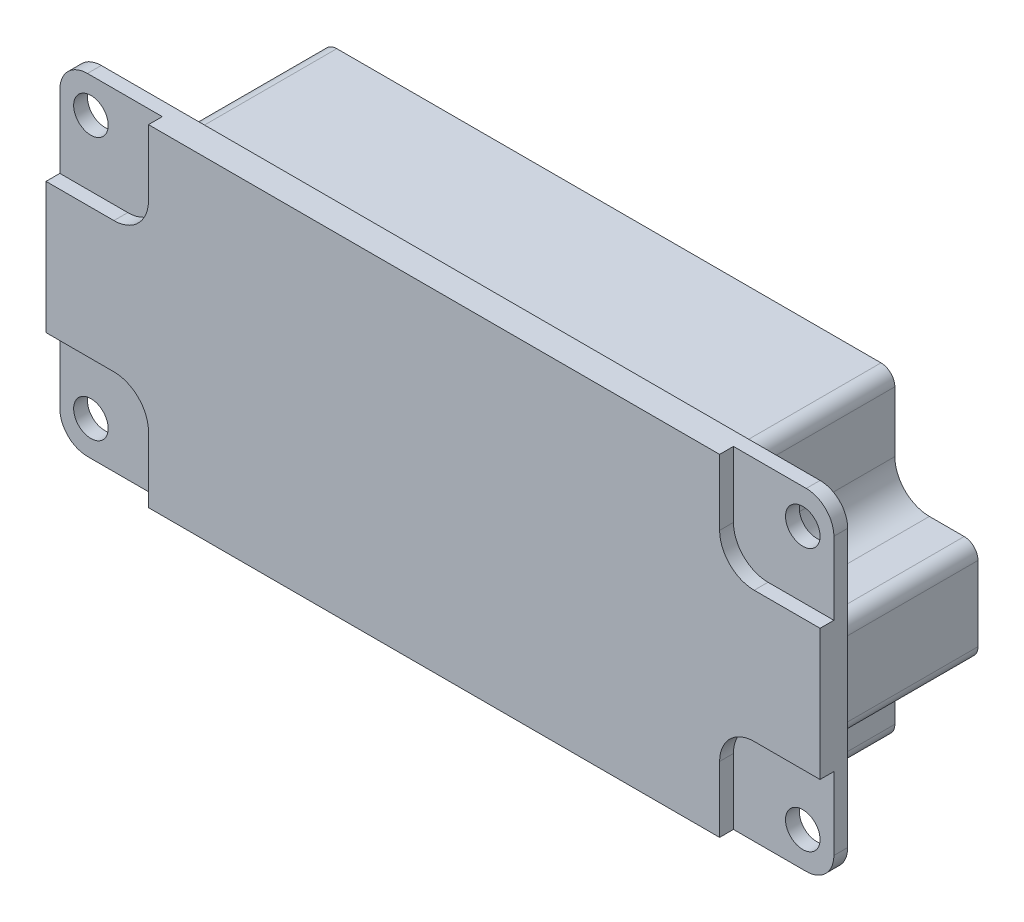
from build123d import *

# Parameters (mm, degrees)
BOSS_EXTRUDE1_DEPTH = 2.54
BOSS_EXTRUDE2_DEPTH = 12.7
SKETCH3_R           = 1.5875
CUT_EXTRUDE1_DEPTH  = 5.08
CUT_EXTRUDE2_DEPTH  = 1.27


with BuildPart() as part:
    # Sketch1 → Boss-Extrude1 (new body)
    with BuildSketch(Plane.XY):
        with BuildLine():
            Line((33.02, -15.24), (-33.02, -15.24))
            ThreePointArc((-33.02, -15.24), (-34.816051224, -14.496051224), (-35.56, -12.7))
            Line((-35.56, -12.7), (-35.56, 12.7))
            ThreePointArc((-35.56, 12.7), (-34.816051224, 14.496051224), (-33.02, 15.24))
            Line((-33.02, 15.24), (33.02, 15.24))
            ThreePointArc((33.02, 15.24), (34.816051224, 14.496051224), (35.56, 12.7))
            Line((35.56, 12.7), (35.56, -12.7))
            ThreePointArc((35.56, -12.7), (34.816051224, -14.496051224), (33.02, -15.24))
        make_face()
    extrude(amount=BOSS_EXTRUDE1_DEPTH)

    # Sketch2 → Boss-Extrude2 (add)
    with BuildSketch(Plane(origin=(0, 0, 0), x_dir=(-1, 0, 0), z_dir=(0, 0, -1))):
        with BuildLine():
            Line((-34.831192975, 3.429443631), (-34.831192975, -3.429443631))
            ThreePointArc((-34.831192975, -3.429443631), (-34.459218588, -4.327469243), (-33.561192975, -4.699443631))
            Line((-33.561192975, -4.699443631), (-30.365638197, -4.699443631))
            ThreePointArc((-30.365638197, -4.699443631), (-28.120574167, -5.629379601), (-27.190638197, -7.874443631))
            Line((-27.190638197, -7.874443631), (-27.190638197, -13.426949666))
            ThreePointArc((-27.190638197, -13.426949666), (-26.818663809, -14.324975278), (-25.920638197, -14.696949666))
            Line((-25.920638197, -14.696949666), (24.081493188, -14.696949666))
            ThreePointArc((24.081493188, -14.696949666), (24.9795188, -14.324975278), (25.351493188, -13.426949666))
            Line((25.351493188, -13.426949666), (25.351493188, -7.874443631))
            ThreePointArc((25.351493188, -7.874443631), (26.281429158, -5.629379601), (28.526493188, -4.699443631))
            Line((28.526493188, -4.699443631), (31.722047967, -4.699443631))
            ThreePointArc((31.722047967, -4.699443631), (32.620073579, -4.327469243), (32.992047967, -3.429443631))
            Line((32.992047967, -3.429443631), (32.992047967, 3.429443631))
            ThreePointArc((32.992047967, 3.429443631), (32.620073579, 4.327469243), (31.722047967, 4.699443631))
            Line((31.722047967, 4.699443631), (28.526493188, 4.699443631))
            ThreePointArc((28.526493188, 4.699443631), (26.281429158, 5.629379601), (25.351493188, 7.874443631))
            Line((25.351493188, 7.874443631), (25.351493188, 13.426949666))
            ThreePointArc((25.351493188, 13.426949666), (24.9795188, 14.324975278), (24.081493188, 14.696949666))
            Line((24.081493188, 14.696949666), (-25.920638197, 14.696949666))
            ThreePointArc((-25.920638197, 14.696949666), (-26.818663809, 14.324975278), (-27.190638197, 13.426949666))
            Line((-27.190638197, 13.426949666), (-27.190638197, 7.874443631))
            ThreePointArc((-27.190638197, 7.874443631), (-28.120574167, 5.629379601), (-30.365638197, 4.699443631))
            Line((-30.365638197, 4.699443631), (-33.561192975, 4.699443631))
            ThreePointArc((-33.561192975, 4.699443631), (-34.459218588, 4.327469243), (-34.831192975, 3.429443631))
        make_face()
    extrude(amount=BOSS_EXTRUDE2_DEPTH)

    # Sketch3 → Cut-Extrude1 (cut)
    with BuildSketch(Plane.XY.offset(2.54)):
        with Locations((32.7025, -12.065)):
            Circle(SKETCH3_R)
        with Locations((32.7025, 12.065)):
            Circle(SKETCH3_R)
        with Locations((-32.7025, 12.065)):
            Circle(SKETCH3_R)
        with Locations((-32.7025, -12.065)):
            Circle(SKETCH3_R)
    extrude(amount=-CUT_EXTRUDE1_DEPTH, mode=Mode.SUBTRACT)

    # Sketch4 → Cut-Extrude2 (cut)
    with BuildSketch(Plane.XY.offset(2.54)):
        with BuildLine():
            Line((-35.56, -6.017135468), (-29.319201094, -6.017135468))
            ThreePointArc((-29.319201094, -6.017135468), (-27.074137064, -6.947071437), (-26.144201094, -9.192135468))
            Line((-26.144201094, -9.192135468), (-26.144201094, -15.24))
            Line((-26.144201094, -15.24), (-35.56, -15.24))
            Line((-35.56, -15.24), (-35.56, -6.017135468))
        make_face()
        with BuildLine():
            Line((35.56, -6.017135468), (29.50710146, -6.017135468))
            ThreePointArc((29.50710146, -6.017135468), (27.26203743, -6.947071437), (26.33210146, -9.192135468))
            Line((26.33210146, -9.192135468), (26.33210146, -15.24))
            Line((26.33210146, -15.24), (35.56, -15.24))
            Line((35.56, -15.24), (35.56, -6.017135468))
        make_face()
        with BuildLine():
            Line((26.33210146, 9.192135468), (26.33210146, 15.24))
            Line((26.33210146, 15.24), (35.56, 15.24))
            Line((35.56, 15.24), (35.56, 6.017135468))
            Line((35.56, 6.017135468), (29.50710146, 6.017135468))
            ThreePointArc((29.50710146, 6.017135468), (27.26203743, 6.947071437), (26.33210146, 9.192135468))
        make_face()
        with BuildLine():
            Line((-26.144201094, 9.192135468), (-26.144201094, 15.24))
            Line((-26.144201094, 15.24), (-35.56, 15.24))
            Line((-35.56, 15.24), (-35.56, 6.017135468))
            Line((-35.56, 6.017135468), (-29.319201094, 6.017135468))
            ThreePointArc((-29.319201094, 6.017135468), (-27.074137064, 6.947071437), (-26.144201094, 9.192135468))
        make_face()
    extrude(amount=-CUT_EXTRUDE2_DEPTH, mode=Mode.SUBTRACT)


solid = part.part
